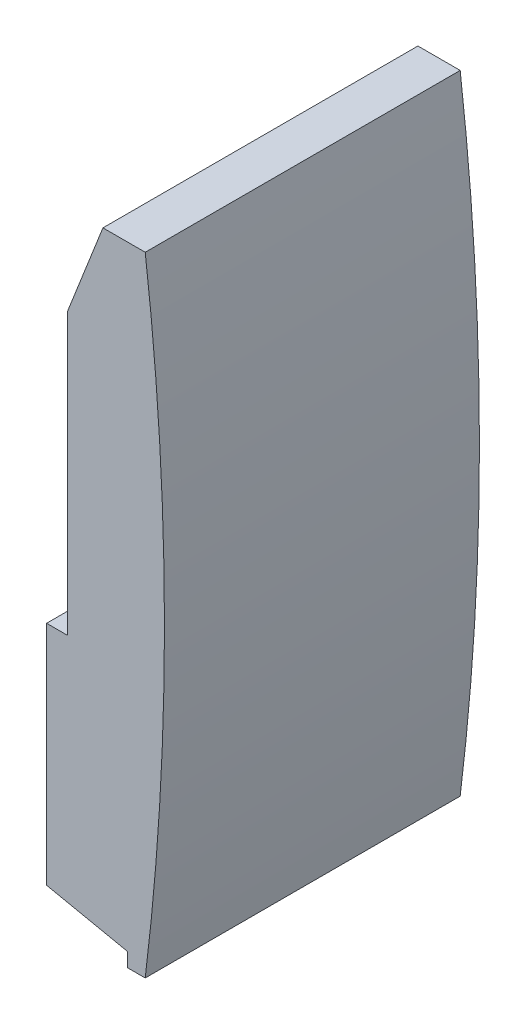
ISO-10303-21;
HEADER;
FILE_DESCRIPTION(('STEP AP214'),'2;1');
FILE_NAME('part.step','',(''),(''),'','','');
FILE_SCHEMA(('AUTOMOTIVE_DESIGN { 1 0 10303 214 1 1 1 1 }'));
ENDSEC;
DATA;
#1=APPLICATION_CONTEXT('core data for automotive mechanical design processes');
#2=APPLICATION_PROTOCOL_DEFINITION('international standard','automotive_design',2000,#1);
#3=PRODUCT_CONTEXT('',#1,'mechanical');
#4=PRODUCT('Part','Part','',(#3));
#5=PRODUCT_RELATED_PRODUCT_CATEGORY('part','',(#4));
#6=PRODUCT_DEFINITION_FORMATION('','',#4);
#7=PRODUCT_DEFINITION_CONTEXT('part definition',#1,'design');
#8=PRODUCT_DEFINITION('design','',#6,#7);
#9=PRODUCT_DEFINITION_SHAPE('','',#8);
#10=(LENGTH_UNIT() NAMED_UNIT(*) SI_UNIT(.MILLI.,.METRE.));
#11=(NAMED_UNIT(*) PLANE_ANGLE_UNIT() SI_UNIT($,.RADIAN.));
#12=(NAMED_UNIT(*) SI_UNIT($,.STERADIAN.) SOLID_ANGLE_UNIT());
#13=UNCERTAINTY_MEASURE_WITH_UNIT(LENGTH_MEASURE(1.E-05),#10,'distance_accuracy_value','');
#14=(GEOMETRIC_REPRESENTATION_CONTEXT(3) GLOBAL_UNCERTAINTY_ASSIGNED_CONTEXT((#13)) GLOBAL_UNIT_ASSIGNED_CONTEXT((#10,
#11,#12)) REPRESENTATION_CONTEXT('',''));
#15=CARTESIAN_POINT('',(0.,0.,0.));
#16=DIRECTION('',(0.,0.,1.));
#17=DIRECTION('',(1.,0.,0.));
#18=AXIS2_PLACEMENT_3D('',#15,#16,#17);
#19=CARTESIAN_POINT('',(349.,-40.2,22.35));
#20=DIRECTION('',(1.,0.,0.));
#21=DIRECTION('',(0.,0.,-1.));
#22=AXIS2_PLACEMENT_3D('',#19,#20,#21);
#23=PLANE('',#22);
#24=DIRECTION('',(0.,-1.,0.));
#25=VECTOR('',#24,1.);
#26=CARTESIAN_POINT('',(349.,-40.2,-22.35));
#27=LINE('',#26,#25);
#28=CARTESIAN_POINT('',(349.,-8.,-22.35));
#29=VERTEX_POINT('',#28);
#30=CARTESIAN_POINT('',(349.,-40.2,-22.35));
#31=VERTEX_POINT('',#30);
#32=EDGE_CURVE('E139',#29,#31,#27,.T.);
#33=ORIENTED_EDGE('',*,*,#32,.T.);
#34=DIRECTION('',(0.,0.,-1.));
#35=VECTOR('',#34,1.);
#36=CARTESIAN_POINT('',(349.,-40.2,22.35));
#37=LINE('',#36,#35);
#38=CARTESIAN_POINT('',(349.,-40.2,22.35));
#39=VERTEX_POINT('',#38);
#40=EDGE_CURVE('E11',#39,#31,#37,.T.);
#41=ORIENTED_EDGE('',*,*,#40,.F.);
#42=DIRECTION('',(0.,-1.,0.));
#43=VECTOR('',#42,1.);
#44=CARTESIAN_POINT('',(349.,-40.2,22.35));
#45=LINE('',#44,#43);
#46=CARTESIAN_POINT('',(349.,-8.,22.35));
#47=VERTEX_POINT('',#46);
#48=EDGE_CURVE('E155',#47,#39,#45,.T.);
#49=ORIENTED_EDGE('',*,*,#48,.F.);
#50=DIRECTION('',(0.,0.,-1.));
#51=VECTOR('',#50,1.);
#52=CARTESIAN_POINT('',(349.,-8.,22.35));
#53=LINE('',#52,#51);
#54=EDGE_CURVE('E135',#47,#29,#53,.T.);
#55=ORIENTED_EDGE('',*,*,#54,.T.);
#56=EDGE_LOOP('',(#33,#41,#49,#55));
#57=FACE_BOUND('',#56,.T.);
#58=ADVANCED_FACE('F37',(#57),#23,.F.);
#59=CARTESIAN_POINT('',(349.,-40.2,22.35));
#60=DIRECTION('',(0.204294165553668,0.978909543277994,0.));
#61=DIRECTION('',(-0.978909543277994,0.204294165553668,0.));
#62=AXIS2_PLACEMENT_3D('',#59,#60,#61);
#63=PLANE('',#62);
#64=DIRECTION('',(0.978909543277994,-0.204294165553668,0.));
#65=VECTOR('',#64,1.);
#66=CARTESIAN_POINT('',(349.,-40.2,-22.35));
#67=LINE('',#66,#65);
#68=CARTESIAN_POINT('',(360.5,-42.6,-22.35));
#69=VERTEX_POINT('',#68);
#70=EDGE_CURVE('E142',#31,#69,#67,.T.);
#71=ORIENTED_EDGE('',*,*,#70,.T.);
#72=DIRECTION('',(0.,0.,-1.));
#73=VECTOR('',#72,1.);
#74=CARTESIAN_POINT('',(360.5,-42.6,22.35));
#75=LINE('',#74,#73);
#76=CARTESIAN_POINT('',(360.5,-42.6,22.35));
#77=VERTEX_POINT('',#76);
#78=EDGE_CURVE('E45',#77,#69,#75,.T.);
#79=ORIENTED_EDGE('',*,*,#78,.F.);
#80=DIRECTION('',(0.978909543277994,-0.204294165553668,0.));
#81=VECTOR('',#80,1.);
#82=CARTESIAN_POINT('',(349.,-40.2,22.35));
#83=LINE('',#82,#81);
#84=EDGE_CURVE('E99',#39,#77,#83,.T.);
#85=ORIENTED_EDGE('',*,*,#84,.F.);
#86=ORIENTED_EDGE('',*,*,#40,.T.);
#87=EDGE_LOOP('',(#71,#79,#85,#86));
#88=FACE_BOUND('',#87,.T.);
#89=ADVANCED_FACE('F198',(#88),#63,.F.);
#90=CARTESIAN_POINT('',(360.5,-42.6,22.35));
#91=DIRECTION('',(1.,0.,0.));
#92=DIRECTION('',(0.,0.,-1.));
#93=AXIS2_PLACEMENT_3D('',#90,#91,#92);
#94=PLANE('',#93);
#95=DIRECTION('',(0.,-1.,0.));
#96=VECTOR('',#95,1.);
#97=CARTESIAN_POINT('',(360.5,-42.6,-22.35));
#98=LINE('',#97,#96);
#99=CARTESIAN_POINT('',(360.5,-44.6,-22.35));
#100=VERTEX_POINT('',#99);
#101=EDGE_CURVE('E144',#69,#100,#98,.T.);
#102=ORIENTED_EDGE('',*,*,#101,.T.);
#103=DIRECTION('',(0.,0.,-1.));
#104=VECTOR('',#103,1.);
#105=CARTESIAN_POINT('',(360.5,-44.6,22.35));
#106=LINE('',#105,#104);
#107=CARTESIAN_POINT('',(360.5,-44.6,22.35));
#108=VERTEX_POINT('',#107);
#109=EDGE_CURVE('E165',#108,#100,#106,.T.);
#110=ORIENTED_EDGE('',*,*,#109,.F.);
#111=DIRECTION('',(0.,-1.,0.));
#112=VECTOR('',#111,1.);
#113=CARTESIAN_POINT('',(360.5,-42.6,22.35));
#114=LINE('',#113,#112);
#115=EDGE_CURVE('E173',#77,#108,#114,.T.);
#116=ORIENTED_EDGE('',*,*,#115,.F.);
#117=ORIENTED_EDGE('',*,*,#78,.T.);
#118=EDGE_LOOP('',(#102,#110,#116,#117));
#119=FACE_BOUND('',#118,.T.);
#120=ADVANCED_FACE('F171',(#119),#94,.F.);
#121=CARTESIAN_POINT('',(360.5,-44.6,22.35));
#122=DIRECTION('',(0.,1.,0.));
#123=DIRECTION('',(0.,0.,1.));
#124=AXIS2_PLACEMENT_3D('',#121,#122,#123);
#125=PLANE('',#124);
#126=DIRECTION('',(1.,0.,0.));
#127=VECTOR('',#126,1.);
#128=CARTESIAN_POINT('',(360.5,-44.6,-22.35));
#129=LINE('',#128,#127);
#130=CARTESIAN_POINT('',(363.,-44.6,-22.35));
#131=VERTEX_POINT('',#130);
#132=EDGE_CURVE('E146',#100,#131,#129,.T.);
#133=ORIENTED_EDGE('',*,*,#132,.T.);
#134=DIRECTION('',(0.,0.,-1.));
#135=VECTOR('',#134,1.);
#136=CARTESIAN_POINT('',(363.,-44.6,22.35));
#137=LINE('',#136,#135);
#138=CARTESIAN_POINT('',(363.,-44.6,22.35));
#139=VERTEX_POINT('',#138);
#140=EDGE_CURVE('E162',#139,#131,#137,.T.);
#141=ORIENTED_EDGE('',*,*,#140,.F.);
#142=DIRECTION('',(1.,0.,0.));
#143=VECTOR('',#142,1.);
#144=CARTESIAN_POINT('',(360.5,-44.6,22.35));
#145=LINE('',#144,#143);
#146=EDGE_CURVE('E189',#108,#139,#145,.T.);
#147=ORIENTED_EDGE('',*,*,#146,.F.);
#148=ORIENTED_EDGE('',*,*,#109,.T.);
#149=EDGE_LOOP('',(#133,#141,#147,#148));
#150=FACE_BOUND('',#149,.T.);
#151=ADVANCED_FACE('F182',(#150),#125,.F.);
#152=CARTESIAN_POINT('',(0.,0.,22.35));
#153=DIRECTION('',(0.,0.,-1.));
#154=DIRECTION('',(-1.,0.,0.));
#155=AXIS2_PLACEMENT_3D('',#152,#153,#154);
#156=CYLINDRICAL_SURFACE('',#155,365.729626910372);
#157=CARTESIAN_POINT('',(0.,0.,-22.35));
#158=DIRECTION('',(0.,0.,1.));
#159=DIRECTION('',(-1.,0.,0.));
#160=AXIS2_PLACEMENT_3D('',#157,#158,#159);
#161=CIRCLE('',#160,365.729626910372);
#162=CARTESIAN_POINT('',(363.,44.6000000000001,-22.35));
#163=VERTEX_POINT('',#162);
#164=EDGE_CURVE('E148',#131,#163,#161,.T.);
#165=ORIENTED_EDGE('',*,*,#164,.T.);
#166=DIRECTION('',(0.,0.,-1.));
#167=VECTOR('',#166,1.);
#168=CARTESIAN_POINT('',(363.,44.6000000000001,22.35));
#169=LINE('',#168,#167);
#170=CARTESIAN_POINT('',(363.,44.6000000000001,22.35));
#171=VERTEX_POINT('',#170);
#172=EDGE_CURVE('E159',#171,#163,#169,.T.);
#173=ORIENTED_EDGE('',*,*,#172,.F.);
#174=CARTESIAN_POINT('',(0.,0.,22.35));
#175=DIRECTION('',(0.,0.,1.));
#176=DIRECTION('',(-1.,0.,0.));
#177=AXIS2_PLACEMENT_3D('',#174,#175,#176);
#178=CIRCLE('',#177,365.729626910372);
#179=EDGE_CURVE('E188',#139,#171,#178,.T.);
#180=ORIENTED_EDGE('',*,*,#179,.F.);
#181=ORIENTED_EDGE('',*,*,#140,.T.);
#182=EDGE_LOOP('',(#165,#173,#180,#181));
#183=FACE_BOUND('',#182,.T.);
#184=ADVANCED_FACE('F186',(#183),#156,.T.);
#185=CARTESIAN_POINT('',(357.,44.6,22.35));
#186=DIRECTION('',(0.,-1.,0.));
#187=DIRECTION('',(0.,0.,-1.));
#188=AXIS2_PLACEMENT_3D('',#185,#186,#187);
#189=PLANE('',#188);
#190=DIRECTION('',(-1.,0.,0.));
#191=VECTOR('',#190,1.);
#192=CARTESIAN_POINT('',(357.,44.6,-22.35));
#193=LINE('',#192,#191);
#194=CARTESIAN_POINT('',(357.,44.6,-22.35));
#195=VERTEX_POINT('',#194);
#196=EDGE_CURVE('E150',#163,#195,#193,.T.);
#197=ORIENTED_EDGE('',*,*,#196,.T.);
#198=DIRECTION('',(0.,0.,-1.));
#199=VECTOR('',#198,1.);
#200=CARTESIAN_POINT('',(357.,44.6,22.35));
#201=LINE('',#200,#199);
#202=CARTESIAN_POINT('',(357.,44.6,22.35));
#203=VERTEX_POINT('',#202);
#204=EDGE_CURVE('E130',#203,#195,#201,.T.);
#205=ORIENTED_EDGE('',*,*,#204,.F.);
#206=DIRECTION('',(-1.,0.,0.));
#207=VECTOR('',#206,1.);
#208=CARTESIAN_POINT('',(357.,44.6,22.35));
#209=LINE('',#208,#207);
#210=EDGE_CURVE('E121',#171,#203,#209,.T.);
#211=ORIENTED_EDGE('',*,*,#210,.F.);
#212=ORIENTED_EDGE('',*,*,#172,.T.);
#213=EDGE_LOOP('',(#197,#205,#211,#212));
#214=FACE_BOUND('',#213,.T.);
#215=ADVANCED_FACE('F210',(#214),#189,.F.);
#216=CARTESIAN_POINT('',(352.,31.9,22.35));
#217=DIRECTION('',(0.930484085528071,-0.366332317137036,0.));
#218=DIRECTION('',(0.366332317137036,0.930484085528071,0.));
#219=AXIS2_PLACEMENT_3D('',#216,#217,#218);
#220=PLANE('',#219);
#221=DIRECTION('',(-0.366332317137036,-0.930484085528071,0.));
#222=VECTOR('',#221,1.);
#223=CARTESIAN_POINT('',(352.,31.9,-22.35));
#224=LINE('',#223,#222);
#225=CARTESIAN_POINT('',(352.,31.9,-22.35));
#226=VERTEX_POINT('',#225);
#227=EDGE_CURVE('E129',#195,#226,#224,.T.);
#228=ORIENTED_EDGE('',*,*,#227,.T.);
#229=DIRECTION('',(0.,0.,-1.));
#230=VECTOR('',#229,1.);
#231=CARTESIAN_POINT('',(352.,31.9,22.35));
#232=LINE('',#231,#230);
#233=CARTESIAN_POINT('',(352.,31.9,22.35));
#234=VERTEX_POINT('',#233);
#235=EDGE_CURVE('E126',#234,#226,#232,.T.);
#236=ORIENTED_EDGE('',*,*,#235,.F.);
#237=DIRECTION('',(-0.366332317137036,-0.930484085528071,0.));
#238=VECTOR('',#237,1.);
#239=CARTESIAN_POINT('',(352.,31.9,22.35));
#240=LINE('',#239,#238);
#241=EDGE_CURVE('E115',#203,#234,#240,.T.);
#242=ORIENTED_EDGE('',*,*,#241,.F.);
#243=ORIENTED_EDGE('',*,*,#204,.T.);
#244=EDGE_LOOP('',(#228,#236,#242,#243));
#245=FACE_BOUND('',#244,.T.);
#246=ADVANCED_FACE('F127',(#245),#220,.F.);
#247=CARTESIAN_POINT('',(352.,-8.,22.35));
#248=DIRECTION('',(1.,0.,0.));
#249=DIRECTION('',(0.,0.,-1.));
#250=AXIS2_PLACEMENT_3D('',#247,#248,#249);
#251=PLANE('',#250);
#252=DIRECTION('',(0.,-1.,0.));
#253=VECTOR('',#252,1.);
#254=CARTESIAN_POINT('',(352.,-8.,-22.35));
#255=LINE('',#254,#253);
#256=CARTESIAN_POINT('',(352.,-8.,-22.35));
#257=VERTEX_POINT('',#256);
#258=EDGE_CURVE('E85',#226,#257,#255,.T.);
#259=ORIENTED_EDGE('',*,*,#258,.T.);
#260=DIRECTION('',(0.,0.,-1.));
#261=VECTOR('',#260,1.);
#262=CARTESIAN_POINT('',(352.,-8.,22.35));
#263=LINE('',#262,#261);
#264=CARTESIAN_POINT('',(352.,-8.,22.35));
#265=VERTEX_POINT('',#264);
#266=EDGE_CURVE('E131',#265,#257,#263,.T.);
#267=ORIENTED_EDGE('',*,*,#266,.F.);
#268=DIRECTION('',(0.,-1.,0.));
#269=VECTOR('',#268,1.);
#270=CARTESIAN_POINT('',(352.,-8.,22.35));
#271=LINE('',#270,#269);
#272=EDGE_CURVE('E119',#234,#265,#271,.T.);
#273=ORIENTED_EDGE('',*,*,#272,.F.);
#274=ORIENTED_EDGE('',*,*,#235,.T.);
#275=EDGE_LOOP('',(#259,#267,#273,#274));
#276=FACE_BOUND('',#275,.T.);
#277=ADVANCED_FACE('F133',(#276),#251,.F.);
#278=CARTESIAN_POINT('',(349.,-8.,22.35));
#279=DIRECTION('',(0.,-1.,0.));
#280=DIRECTION('',(0.,0.,-1.));
#281=AXIS2_PLACEMENT_3D('',#278,#279,#280);
#282=PLANE('',#281);
#283=DIRECTION('',(-1.,0.,0.));
#284=VECTOR('',#283,1.);
#285=CARTESIAN_POINT('',(349.,-8.,-22.35));
#286=LINE('',#285,#284);
#287=EDGE_CURVE('E91',#257,#29,#286,.T.);
#288=ORIENTED_EDGE('',*,*,#287,.T.);
#289=ORIENTED_EDGE('',*,*,#54,.F.);
#290=DIRECTION('',(-1.,0.,0.));
#291=VECTOR('',#290,1.);
#292=CARTESIAN_POINT('',(349.,-8.,22.35));
#293=LINE('',#292,#291);
#294=EDGE_CURVE('E53',#265,#47,#293,.T.);
#295=ORIENTED_EDGE('',*,*,#294,.F.);
#296=ORIENTED_EDGE('',*,*,#266,.T.);
#297=EDGE_LOOP('',(#288,#289,#295,#296));
#298=FACE_BOUND('',#297,.T.);
#299=ADVANCED_FACE('F218',(#298),#282,.F.);
#300=CARTESIAN_POINT('',(0.,0.,22.35));
#301=DIRECTION('',(0.,0.,-1.));
#302=DIRECTION('',(-1.,0.,0.));
#303=AXIS2_PLACEMENT_3D('',#300,#301,#302);
#304=PLANE('',#303);
#305=ORIENTED_EDGE('',*,*,#48,.T.);
#306=ORIENTED_EDGE('',*,*,#84,.T.);
#307=ORIENTED_EDGE('',*,*,#115,.T.);
#308=ORIENTED_EDGE('',*,*,#146,.T.);
#309=ORIENTED_EDGE('',*,*,#179,.T.);
#310=ORIENTED_EDGE('',*,*,#210,.T.);
#311=ORIENTED_EDGE('',*,*,#241,.T.);
#312=ORIENTED_EDGE('',*,*,#272,.T.);
#313=ORIENTED_EDGE('',*,*,#294,.T.);
#314=EDGE_LOOP('',(#305,#306,#307,#308,#309,#310,#311,#312,#313));
#315=FACE_BOUND('',#314,.T.);
#316=ADVANCED_FACE('F117',(#315),#304,.F.);
#317=CARTESIAN_POINT('',(0.,0.,-22.35));
#318=DIRECTION('',(0.,0.,-1.));
#319=DIRECTION('',(-1.,0.,0.));
#320=AXIS2_PLACEMENT_3D('',#317,#318,#319);
#321=PLANE('',#320);
#322=ORIENTED_EDGE('',*,*,#32,.F.);
#323=ORIENTED_EDGE('',*,*,#287,.F.);
#324=ORIENTED_EDGE('',*,*,#258,.F.);
#325=ORIENTED_EDGE('',*,*,#227,.F.);
#326=ORIENTED_EDGE('',*,*,#196,.F.);
#327=ORIENTED_EDGE('',*,*,#164,.F.);
#328=ORIENTED_EDGE('',*,*,#132,.F.);
#329=ORIENTED_EDGE('',*,*,#101,.F.);
#330=ORIENTED_EDGE('',*,*,#70,.F.);
#331=EDGE_LOOP('',(#322,#323,#324,#325,#326,#327,#328,#329,#330));
#332=FACE_BOUND('',#331,.T.);
#333=ADVANCED_FACE('F177',(#332),#321,.T.);
#334=CLOSED_SHELL('',(#58,#89,#120,#151,#184,#215,#246,#277,#299,#316,#333));
#335=MANIFOLD_SOLID_BREP('B2',#334);
#336=ADVANCED_BREP_SHAPE_REPRESENTATION('',(#18,#335),#14);
#337=SHAPE_DEFINITION_REPRESENTATION(#9,#336);
ENDSEC;
END-ISO-10303-21;
